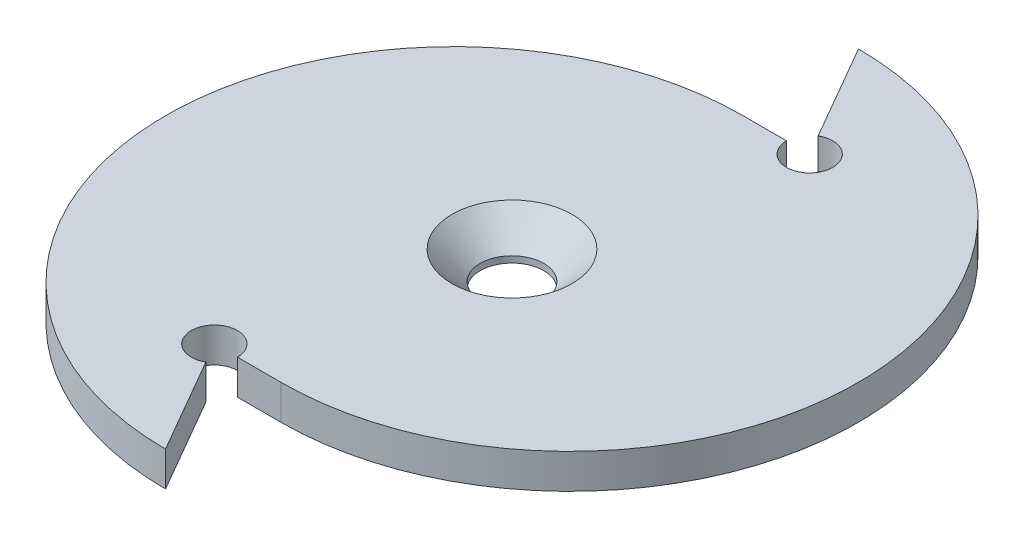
ISO-10303-21;
HEADER;
FILE_DESCRIPTION(('STEP AP214'),'2;1');
FILE_NAME('part.step','',(''),(''),'','','');
FILE_SCHEMA(('AUTOMOTIVE_DESIGN { 1 0 10303 214 1 1 1 1 }'));
ENDSEC;
DATA;
#1=APPLICATION_CONTEXT('core data for automotive mechanical design processes');
#2=APPLICATION_PROTOCOL_DEFINITION('international standard','automotive_design',2000,#1);
#3=PRODUCT_CONTEXT('',#1,'mechanical');
#4=PRODUCT('Part','Part','',(#3));
#5=PRODUCT_RELATED_PRODUCT_CATEGORY('part','',(#4));
#6=PRODUCT_DEFINITION_FORMATION('','',#4);
#7=PRODUCT_DEFINITION_CONTEXT('part definition',#1,'design');
#8=PRODUCT_DEFINITION('design','',#6,#7);
#9=PRODUCT_DEFINITION_SHAPE('','',#8);
#10=(LENGTH_UNIT() NAMED_UNIT(*) SI_UNIT(.MILLI.,.METRE.));
#11=(NAMED_UNIT(*) PLANE_ANGLE_UNIT() SI_UNIT($,.RADIAN.));
#12=(NAMED_UNIT(*) SI_UNIT($,.STERADIAN.) SOLID_ANGLE_UNIT());
#13=UNCERTAINTY_MEASURE_WITH_UNIT(LENGTH_MEASURE(1.E-05),#10,'distance_accuracy_value','');
#14=(GEOMETRIC_REPRESENTATION_CONTEXT(3) GLOBAL_UNCERTAINTY_ASSIGNED_CONTEXT((#13)) GLOBAL_UNIT_ASSIGNED_CONTEXT((#10,
#11,#12)) REPRESENTATION_CONTEXT('',''));
#15=CARTESIAN_POINT('',(0.,0.,0.));
#16=DIRECTION('',(0.,0.,1.));
#17=DIRECTION('',(1.,0.,0.));
#18=AXIS2_PLACEMENT_3D('',#15,#16,#17);
#19=CARTESIAN_POINT('',(0.,3.,5.));
#20=DIRECTION('',(0.,-1.,0.));
#21=DIRECTION('',(0.,0.,-1.));
#22=AXIS2_PLACEMENT_3D('',#19,#20,#21);
#23=CYLINDRICAL_SURFACE('',#22,25.);
#24=CARTESIAN_POINT('',(0.,0.,5.));
#25=DIRECTION('',(0.,1.,0.));
#26=DIRECTION('',(0.,0.,1.));
#27=AXIS2_PLACEMENT_3D('',#24,#25,#26);
#28=CIRCLE('',#27,25.);
#29=CARTESIAN_POINT('',(0.,0.,-20.));
#30=VERTEX_POINT('',#29);
#31=CARTESIAN_POINT('',(0.,0.,30.));
#32=VERTEX_POINT('',#31);
#33=EDGE_CURVE('E127',#30,#32,#28,.T.);
#34=ORIENTED_EDGE('',*,*,#33,.T.);
#35=DIRECTION('',(0.,-1.,0.));
#36=VECTOR('',#35,1.);
#37=CARTESIAN_POINT('',(0.,3.,30.));
#38=LINE('',#37,#36);
#39=CARTESIAN_POINT('',(0.,3.,30.));
#40=VERTEX_POINT('',#39);
#41=EDGE_CURVE('E11',#40,#32,#38,.T.);
#42=ORIENTED_EDGE('',*,*,#41,.F.);
#43=CARTESIAN_POINT('',(0.,3.,5.));
#44=DIRECTION('',(0.,1.,0.));
#45=DIRECTION('',(0.,0.,1.));
#46=AXIS2_PLACEMENT_3D('',#43,#44,#45);
#47=CIRCLE('',#46,25.);
#48=CARTESIAN_POINT('',(0.,3.,-20.));
#49=VERTEX_POINT('',#48);
#50=EDGE_CURVE('E142',#49,#40,#47,.T.);
#51=ORIENTED_EDGE('',*,*,#50,.F.);
#52=DIRECTION('',(0.,-1.,0.));
#53=VECTOR('',#52,1.);
#54=CARTESIAN_POINT('',(0.,3.,-20.));
#55=LINE('',#54,#53);
#56=EDGE_CURVE('E123',#49,#30,#55,.T.);
#57=ORIENTED_EDGE('',*,*,#56,.T.);
#58=EDGE_LOOP('',(#34,#42,#51,#57));
#59=FACE_BOUND('',#58,.T.);
#60=ADVANCED_FACE('F31',(#59),#23,.T.);
#61=CARTESIAN_POINT('',(0.,3.,30.));
#62=DIRECTION('',(-0.86602540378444,0.,0.499999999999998));
#63=DIRECTION('',(0.499999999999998,0.,0.86602540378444));
#64=AXIS2_PLACEMENT_3D('',#61,#62,#63);
#65=PLANE('',#64);
#66=DIRECTION('',(-0.499999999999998,0.,-0.86602540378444));
#67=VECTOR('',#66,1.);
#68=CARTESIAN_POINT('',(0.,0.,30.));
#69=LINE('',#68,#67);
#70=CARTESIAN_POINT('',(-4.77350269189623,0.,21.7320508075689));
#71=VERTEX_POINT('',#70);
#72=EDGE_CURVE('E130',#32,#71,#69,.T.);
#73=ORIENTED_EDGE('',*,*,#72,.T.);
#74=DIRECTION('',(0.,-1.,0.));
#75=VECTOR('',#74,1.);
#76=CARTESIAN_POINT('',(-4.77350269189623,3.,21.7320508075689));
#77=LINE('',#76,#75);
#78=CARTESIAN_POINT('',(-4.77350269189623,3.,21.7320508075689));
#79=VERTEX_POINT('',#78);
#80=EDGE_CURVE('E39',#79,#71,#77,.T.);
#81=ORIENTED_EDGE('',*,*,#80,.F.);
#82=DIRECTION('',(-0.499999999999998,0.,-0.86602540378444));
#83=VECTOR('',#82,1.);
#84=CARTESIAN_POINT('',(0.,3.,30.));
#85=LINE('',#84,#83);
#86=EDGE_CURVE('E90',#40,#79,#85,.T.);
#87=ORIENTED_EDGE('',*,*,#86,.F.);
#88=ORIENTED_EDGE('',*,*,#41,.T.);
#89=EDGE_LOOP('',(#73,#81,#87,#88));
#90=FACE_BOUND('',#89,.T.);
#91=ADVANCED_FACE('F199',(#90),#65,.F.);
#92=CARTESIAN_POINT('',(-5.77350269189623,3.,20.));
#93=DIRECTION('',(0.,-1.,0.));
#94=DIRECTION('',(0.,0.,-1.));
#95=AXIS2_PLACEMENT_3D('',#92,#93,#94);
#96=CYLINDRICAL_SURFACE('',#95,2.);
#97=CARTESIAN_POINT('',(-5.77350269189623,0.,20.));
#98=DIRECTION('',(0.,-1.,0.));
#99=DIRECTION('',(0.,0.,1.));
#100=AXIS2_PLACEMENT_3D('',#97,#98,#99);
#101=CIRCLE('',#100,2.);
#102=CARTESIAN_POINT('',(-3.77350269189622,0.,20.));
#103=VERTEX_POINT('',#102);
#104=EDGE_CURVE('E133',#71,#103,#101,.T.);
#105=ORIENTED_EDGE('',*,*,#104,.T.);
#106=DIRECTION('',(0.,-1.,0.));
#107=VECTOR('',#106,1.);
#108=CARTESIAN_POINT('',(-3.77350269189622,3.,20.));
#109=LINE('',#108,#107);
#110=CARTESIAN_POINT('',(-3.77350269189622,3.,20.));
#111=VERTEX_POINT('',#110);
#112=EDGE_CURVE('E149',#111,#103,#109,.T.);
#113=ORIENTED_EDGE('',*,*,#112,.F.);
#114=CARTESIAN_POINT('',(-5.77350269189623,3.,20.));
#115=DIRECTION('',(0.,-1.,0.));
#116=DIRECTION('',(0.,0.,1.));
#117=AXIS2_PLACEMENT_3D('',#114,#115,#116);
#118=CIRCLE('',#117,2.);
#119=EDGE_CURVE('E157',#79,#111,#118,.T.);
#120=ORIENTED_EDGE('',*,*,#119,.F.);
#121=ORIENTED_EDGE('',*,*,#80,.T.);
#122=EDGE_LOOP('',(#105,#113,#120,#121));
#123=FACE_BOUND('',#122,.T.);
#124=ADVANCED_FACE('F155',(#123),#96,.F.);
#125=CARTESIAN_POINT('',(0.,3.,20.));
#126=DIRECTION('',(0.,0.,-1.));
#127=DIRECTION('',(-1.,0.,0.));
#128=AXIS2_PLACEMENT_3D('',#125,#126,#127);
#129=PLANE('',#128);
#130=DIRECTION('',(1.,0.,0.));
#131=VECTOR('',#130,1.);
#132=CARTESIAN_POINT('',(0.,0.,20.));
#133=LINE('',#132,#131);
#134=CARTESIAN_POINT('',(0.,0.,20.));
#135=VERTEX_POINT('',#134);
#136=EDGE_CURVE('E135',#103,#135,#133,.T.);
#137=ORIENTED_EDGE('',*,*,#136,.T.);
#138=DIRECTION('',(0.,-1.,0.));
#139=VECTOR('',#138,1.);
#140=CARTESIAN_POINT('',(0.,3.,20.));
#141=LINE('',#140,#139);
#142=CARTESIAN_POINT('',(0.,3.,20.));
#143=VERTEX_POINT('',#142);
#144=EDGE_CURVE('E146',#143,#135,#141,.T.);
#145=ORIENTED_EDGE('',*,*,#144,.F.);
#146=DIRECTION('',(1.,0.,0.));
#147=VECTOR('',#146,1.);
#148=CARTESIAN_POINT('',(0.,3.,20.));
#149=LINE('',#148,#147);
#150=EDGE_CURVE('E169',#111,#143,#149,.T.);
#151=ORIENTED_EDGE('',*,*,#150,.F.);
#152=ORIENTED_EDGE('',*,*,#112,.T.);
#153=EDGE_LOOP('',(#137,#145,#151,#152));
#154=FACE_BOUND('',#153,.T.);
#155=ADVANCED_FACE('F165',(#154),#129,.F.);
#156=CARTESIAN_POINT('',(0.,3.,-5.));
#157=DIRECTION('',(0.,-1.,0.));
#158=DIRECTION('',(0.,0.,-1.));
#159=AXIS2_PLACEMENT_3D('',#156,#157,#158);
#160=CYLINDRICAL_SURFACE('',#159,25.);
#161=CARTESIAN_POINT('',(0.,0.,-5.));
#162=DIRECTION('',(0.,1.,0.));
#163=DIRECTION('',(0.,0.,1.));
#164=AXIS2_PLACEMENT_3D('',#161,#162,#163);
#165=CIRCLE('',#164,25.);
#166=CARTESIAN_POINT('',(0.,0.,-30.));
#167=VERTEX_POINT('',#166);
#168=EDGE_CURVE('E137',#135,#167,#165,.T.);
#169=ORIENTED_EDGE('',*,*,#168,.T.);
#170=DIRECTION('',(0.,-1.,0.));
#171=VECTOR('',#170,1.);
#172=CARTESIAN_POINT('',(0.,3.,-30.));
#173=LINE('',#172,#171);
#174=CARTESIAN_POINT('',(0.,3.,-30.));
#175=VERTEX_POINT('',#174);
#176=EDGE_CURVE('E118',#175,#167,#173,.T.);
#177=ORIENTED_EDGE('',*,*,#176,.F.);
#178=CARTESIAN_POINT('',(0.,3.,-5.));
#179=DIRECTION('',(0.,1.,0.));
#180=DIRECTION('',(0.,0.,1.));
#181=AXIS2_PLACEMENT_3D('',#178,#179,#180);
#182=CIRCLE('',#181,25.);
#183=EDGE_CURVE('E109',#143,#175,#182,.T.);
#184=ORIENTED_EDGE('',*,*,#183,.F.);
#185=ORIENTED_EDGE('',*,*,#144,.T.);
#186=EDGE_LOOP('',(#169,#177,#184,#185));
#187=FACE_BOUND('',#186,.T.);
#188=ADVANCED_FACE('F168',(#187),#160,.T.);
#189=CARTESIAN_POINT('',(0.,3.,-30.));
#190=DIRECTION('',(0.86602540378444,0.,-0.499999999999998));
#191=DIRECTION('',(-0.499999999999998,0.,-0.86602540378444));
#192=AXIS2_PLACEMENT_3D('',#189,#190,#191);
#193=PLANE('',#192);
#194=DIRECTION('',(0.499999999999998,0.,0.86602540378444));
#195=VECTOR('',#194,1.);
#196=CARTESIAN_POINT('',(0.,0.,-30.));
#197=LINE('',#196,#195);
#198=CARTESIAN_POINT('',(4.77350269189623,0.,-21.7320508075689));
#199=VERTEX_POINT('',#198);
#200=EDGE_CURVE('E117',#167,#199,#197,.T.);
#201=ORIENTED_EDGE('',*,*,#200,.T.);
#202=DIRECTION('',(0.,-1.,0.));
#203=VECTOR('',#202,1.);
#204=CARTESIAN_POINT('',(4.77350269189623,3.,-21.7320508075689));
#205=LINE('',#204,#203);
#206=CARTESIAN_POINT('',(4.77350269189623,3.,-21.7320508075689));
#207=VERTEX_POINT('',#206);
#208=EDGE_CURVE('E114',#207,#199,#205,.T.);
#209=ORIENTED_EDGE('',*,*,#208,.F.);
#210=DIRECTION('',(0.499999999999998,0.,0.86602540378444));
#211=VECTOR('',#210,1.);
#212=CARTESIAN_POINT('',(0.,3.,-30.));
#213=LINE('',#212,#211);
#214=EDGE_CURVE('E103',#175,#207,#213,.T.);
#215=ORIENTED_EDGE('',*,*,#214,.F.);
#216=ORIENTED_EDGE('',*,*,#176,.T.);
#217=EDGE_LOOP('',(#201,#209,#215,#216));
#218=FACE_BOUND('',#217,.T.);
#219=ADVANCED_FACE('F115',(#218),#193,.F.);
#220=CARTESIAN_POINT('',(5.77350269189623,3.,-20.));
#221=DIRECTION('',(0.,-1.,0.));
#222=DIRECTION('',(0.,0.,-1.));
#223=AXIS2_PLACEMENT_3D('',#220,#221,#222);
#224=CYLINDRICAL_SURFACE('',#223,2.);
#225=CARTESIAN_POINT('',(5.77350269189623,0.,-20.));
#226=DIRECTION('',(0.,-1.,0.));
#227=DIRECTION('',(0.,0.,1.));
#228=AXIS2_PLACEMENT_3D('',#225,#226,#227);
#229=CIRCLE('',#228,2.);
#230=CARTESIAN_POINT('',(3.77350269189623,0.,-20.));
#231=VERTEX_POINT('',#230);
#232=EDGE_CURVE('E76',#199,#231,#229,.T.);
#233=ORIENTED_EDGE('',*,*,#232,.T.);
#234=DIRECTION('',(0.,-1.,0.));
#235=VECTOR('',#234,1.);
#236=CARTESIAN_POINT('',(3.77350269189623,3.,-20.));
#237=LINE('',#236,#235);
#238=CARTESIAN_POINT('',(3.77350269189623,3.,-20.));
#239=VERTEX_POINT('',#238);
#240=EDGE_CURVE('E119',#239,#231,#237,.T.);
#241=ORIENTED_EDGE('',*,*,#240,.F.);
#242=CARTESIAN_POINT('',(5.77350269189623,3.,-20.));
#243=DIRECTION('',(0.,-1.,0.));
#244=DIRECTION('',(0.,0.,1.));
#245=AXIS2_PLACEMENT_3D('',#242,#243,#244);
#246=CIRCLE('',#245,2.);
#247=EDGE_CURVE('E107',#207,#239,#246,.T.);
#248=ORIENTED_EDGE('',*,*,#247,.F.);
#249=ORIENTED_EDGE('',*,*,#208,.T.);
#250=EDGE_LOOP('',(#233,#241,#248,#249));
#251=FACE_BOUND('',#250,.T.);
#252=ADVANCED_FACE('F121',(#251),#224,.F.);
#253=CARTESIAN_POINT('',(0.,3.,-20.));
#254=DIRECTION('',(0.,0.,1.));
#255=DIRECTION('',(1.,0.,0.));
#256=AXIS2_PLACEMENT_3D('',#253,#254,#255);
#257=PLANE('',#256);
#258=DIRECTION('',(-1.,0.,0.));
#259=VECTOR('',#258,1.);
#260=CARTESIAN_POINT('',(0.,0.,-20.));
#261=LINE('',#260,#259);
#262=EDGE_CURVE('E82',#231,#30,#261,.T.);
#263=ORIENTED_EDGE('',*,*,#262,.T.);
#264=ORIENTED_EDGE('',*,*,#56,.F.);
#265=DIRECTION('',(-1.,0.,0.));
#266=VECTOR('',#265,1.);
#267=CARTESIAN_POINT('',(0.,3.,-20.));
#268=LINE('',#267,#266);
#269=EDGE_CURVE('E47',#239,#49,#268,.T.);
#270=ORIENTED_EDGE('',*,*,#269,.F.);
#271=ORIENTED_EDGE('',*,*,#240,.T.);
#272=EDGE_LOOP('',(#263,#264,#270,#271));
#273=FACE_BOUND('',#272,.T.);
#274=ADVANCED_FACE('F187',(#273),#257,.F.);
#275=CARTESIAN_POINT('',(0.,3.,5.));
#276=DIRECTION('',(0.,1.,0.));
#277=DIRECTION('',(0.,0.,1.));
#278=AXIS2_PLACEMENT_3D('',#275,#276,#277);
#279=PLANE('',#278);
#280=CARTESIAN_POINT('',(0.,3.,0.));
#281=DIRECTION('',(0.,1.,0.));
#282=DIRECTION('',(0.,0.,1.));
#283=AXIS2_PLACEMENT_3D('',#280,#281,#282);
#284=CIRCLE('',#283,5.2);
#285=CARTESIAN_POINT('',(0.,3.,5.2));
#286=VERTEX_POINT('',#285);
#287=EDGE_CURVE('E180',#286,#286,#284,.T.);
#288=ORIENTED_EDGE('',*,*,#287,.F.);
#289=EDGE_LOOP('',(#288));
#290=FACE_BOUND('',#289,.T.);
#291=ORIENTED_EDGE('',*,*,#50,.T.);
#292=ORIENTED_EDGE('',*,*,#86,.T.);
#293=ORIENTED_EDGE('',*,*,#119,.T.);
#294=ORIENTED_EDGE('',*,*,#150,.T.);
#295=ORIENTED_EDGE('',*,*,#183,.T.);
#296=ORIENTED_EDGE('',*,*,#214,.T.);
#297=ORIENTED_EDGE('',*,*,#247,.T.);
#298=ORIENTED_EDGE('',*,*,#269,.T.);
#299=EDGE_LOOP('',(#291,#292,#293,#294,#295,#296,#297,#298));
#300=FACE_BOUND('',#299,.T.);
#301=ADVANCED_FACE('F105',(#290,#300),#279,.T.);
#302=CARTESIAN_POINT('',(0.,0.,5.));
#303=DIRECTION('',(0.,1.,0.));
#304=DIRECTION('',(0.,0.,1.));
#305=AXIS2_PLACEMENT_3D('',#302,#303,#304);
#306=PLANE('',#305);
#307=CARTESIAN_POINT('',(0.,0.,0.));
#308=DIRECTION('',(0.,1.,0.));
#309=DIRECTION('',(0.,0.,1.));
#310=AXIS2_PLACEMENT_3D('',#307,#308,#309);
#311=CIRCLE('',#310,2.75);
#312=CARTESIAN_POINT('',(0.,0.,2.75));
#313=VERTEX_POINT('',#312);
#314=EDGE_CURVE('E131',#313,#313,#311,.T.);
#315=ORIENTED_EDGE('',*,*,#314,.T.);
#316=EDGE_LOOP('',(#315));
#317=FACE_BOUND('',#316,.T.);
#318=ORIENTED_EDGE('',*,*,#33,.F.);
#319=ORIENTED_EDGE('',*,*,#262,.F.);
#320=ORIENTED_EDGE('',*,*,#232,.F.);
#321=ORIENTED_EDGE('',*,*,#200,.F.);
#322=ORIENTED_EDGE('',*,*,#168,.F.);
#323=ORIENTED_EDGE('',*,*,#136,.F.);
#324=ORIENTED_EDGE('',*,*,#104,.F.);
#325=ORIENTED_EDGE('',*,*,#72,.F.);
#326=EDGE_LOOP('',(#318,#319,#320,#321,#322,#323,#324,#325));
#327=FACE_BOUND('',#326,.T.);
#328=ADVANCED_FACE('F161',(#317,#327),#306,.F.);
#329=CARTESIAN_POINT('',(0.,3.,0.));
#330=DIRECTION('',(0.,1.,0.));
#331=DIRECTION('',(0.,0.,1.));
#332=AXIS2_PLACEMENT_3D('',#329,#330,#331);
#333=CYLINDRICAL_SURFACE('',#332,2.75);
#334=ORIENTED_EDGE('',*,*,#314,.F.);
#335=EDGE_LOOP('',(#334));
#336=FACE_BOUND('',#335,.T.);
#337=CARTESIAN_POINT('',(0.,0.549999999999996,0.));
#338=DIRECTION('',(0.,1.,0.));
#339=DIRECTION('',(0.,0.,1.));
#340=AXIS2_PLACEMENT_3D('',#337,#338,#339);
#341=CIRCLE('',#340,2.75);
#342=CARTESIAN_POINT('',(0.,0.549999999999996,2.75));
#343=VERTEX_POINT('',#342);
#344=EDGE_CURVE('E177',#343,#343,#341,.T.);
#345=ORIENTED_EDGE('',*,*,#344,.T.);
#346=EDGE_LOOP('',(#345));
#347=FACE_BOUND('',#346,.T.);
#348=ADVANCED_FACE('F193',(#336,#347),#333,.F.);
#349=CARTESIAN_POINT('',(0.,3.,0.));
#350=DIRECTION('',(0.,1.,0.));
#351=DIRECTION('',(0.,0.,1.));
#352=AXIS2_PLACEMENT_3D('',#349,#350,#351);
#353=CONICAL_SURFACE('',#352,5.2,0.785398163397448);
#354=ORIENTED_EDGE('',*,*,#344,.F.);
#355=EDGE_LOOP('',(#354));
#356=FACE_BOUND('',#355,.T.);
#357=ORIENTED_EDGE('',*,*,#287,.T.);
#358=EDGE_LOOP('',(#357));
#359=FACE_BOUND('',#358,.T.);
#360=ADVANCED_FACE('F184',(#356,#359),#353,.F.);
#361=CLOSED_SHELL('',(#60,#91,#124,#155,#188,#219,#252,#274,#301,#328,#348,#360));
#362=MANIFOLD_SOLID_BREP('B2',#361);
#363=ADVANCED_BREP_SHAPE_REPRESENTATION('',(#18,#362),#14);
#364=SHAPE_DEFINITION_REPRESENTATION(#9,#363);
ENDSEC;
END-ISO-10303-21;
